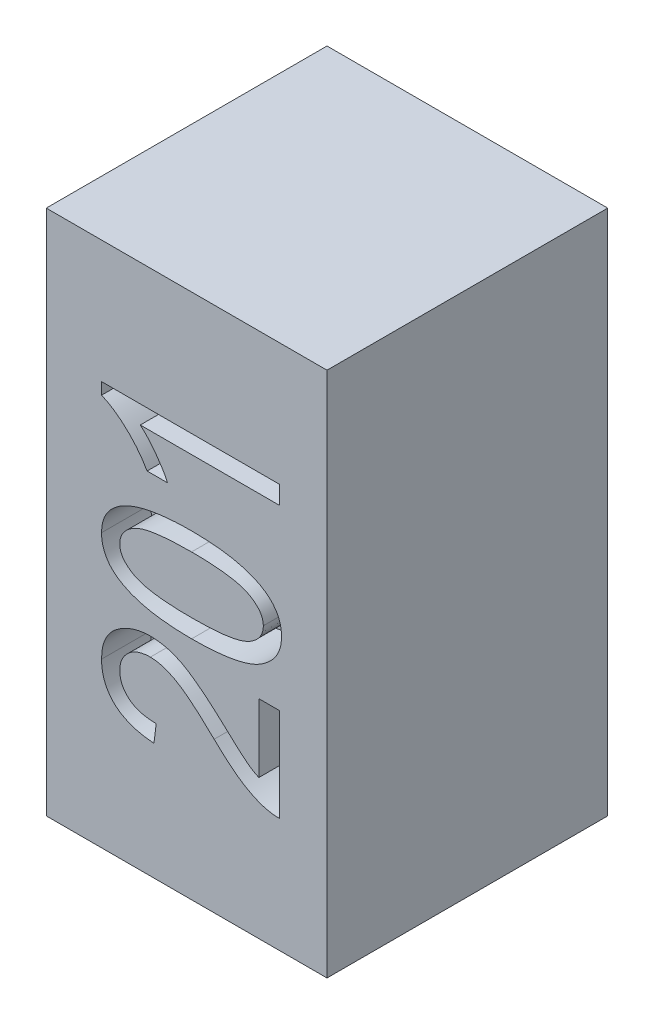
from build123d import *

# Parameters (mm, degrees)
ESQUISSE1_W             = 0.8
ESQUISSE1_H             = 1.5
BOSS_EXTRU_1_DEPTH      = 0.8
ENL_V_MAT_EXTRU_1_DEPTH = 0.14


with BuildPart() as part:
    # Esquisse1 → Boss.-Extru.1 (new body)
    with BuildSketch(Plane.XY):
        Rectangle(ESQUISSE1_W, ESQUISSE1_H)
    extrude(amount=BOSS_EXTRU_1_DEPTH)

    # Esquisse2 → Enl_v. mat.-Extru.1 (cut)
    # profile 1 of 3: a face of its own
    with BuildSketch(Plane.XY.offset(0.8)):
        with BuildLine():
            Line((0.205570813, -0.157792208), (0.264012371, -0.157792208))
            Line((0.264012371, -0.157792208), (0.264012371, -0.424025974))
            add(Edge.make_bspline(
                [(0.264012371, -0.424025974), (0.260967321, -0.424038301), (0.254798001, -0.424063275), (0.245392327, -0.423232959), (0.235758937, -0.421527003), (0.22576932, -0.41934867), (0.215554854, -0.416260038), (0.205065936, -0.412478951), (0.194328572, -0.408017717), (0.183279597, -0.402793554), (0.171811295, -0.396690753), (0.159978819, -0.389318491), (0.147562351, -0.38089399), (0.134716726, -0.371213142), (0.12131985, -0.360450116), (0.10743377, -0.348551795), (0.092982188, -0.33556787), (0.083383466, -0.326315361), (0.078440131, -0.321550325)],
                knots=[0, 0, 0, 0, 0.672196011, 1.361880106, 2.081368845, 2.831486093, 3.618364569, 4.435734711, 5.292876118, 6.184871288, 7.133796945, 8.159796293, 9.26180684, 10.446293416, 11.710635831, 13.056147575, 14.483918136, 16, 16, 16, 16], degree=3))
            add(Edge.make_bspline(
                [(0.078440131, -0.321550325), (0.072713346, -0.316013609), (0.061686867, -0.305353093), (0.045405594, -0.290349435), (0.030272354, -0.276717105), (0.016013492, -0.264728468), (0.002823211, -0.254170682), (-0.009279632, -0.244937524), (-0.020569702, -0.237470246), (-0.033854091, -0.229407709), (-0.049668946, -0.221721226), (-0.068103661, -0.214925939), (-0.085924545, -0.210535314), (-0.097673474, -0.210000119), (-0.103378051, -0.20974026)],
                knots=[0, 0, 0, 0, 1.312560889, 2.527233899, 3.64818266, 4.668586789, 5.596397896, 6.432357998, 7.175835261, 7.825761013, 8.992224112, 10.065918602, 11.060925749, 12, 12, 12, 12], degree=3))
            add(Edge.make_bspline(
                [(-0.103378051, -0.20974026), (-0.106527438, -0.209776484), (-0.112678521, -0.209847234), (-0.121661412, -0.211049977), (-0.130205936, -0.212764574), (-0.138371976, -0.215030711), (-0.146032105, -0.218235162), (-0.153239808, -0.222118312), (-0.160090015, -0.226558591), (-0.16634486, -0.231739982), (-0.171987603, -0.237403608), (-0.177039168, -0.243386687), (-0.181168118, -0.24979007), (-0.184588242, -0.256481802), (-0.187205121, -0.26350197), (-0.18916589, -0.27083284), (-0.19027981, -0.278496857), (-0.190447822, -0.283701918), (-0.190533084, -0.286343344)],
                knots=[0, 0, 0, 0, 1.164144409, 2.273695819, 3.345940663, 4.387378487, 5.402712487, 6.410231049, 7.41307794, 8.417484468, 9.408318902, 10.367853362, 11.308274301, 12.220303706, 13.142827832, 14.074469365, 15.022846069, 16, 16, 16, 16], degree=3))
            add(Edge.make_bspline(
                [(-0.190533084, -0.286343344), (-0.190473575, -0.289191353), (-0.190357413, -0.294750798), (-0.188904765, -0.302851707), (-0.186978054, -0.3106229), (-0.183932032, -0.317967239), (-0.180250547, -0.325024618), (-0.175445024, -0.331504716), (-0.170081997, -0.337780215), (-0.163790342, -0.343548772), (-0.156646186, -0.34869795), (-0.148843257, -0.35331999), (-0.140187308, -0.357045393), (-0.130892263, -0.360176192), (-0.120846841, -0.362635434), (-0.110082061, -0.364277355), (-0.098602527, -0.36548204), (-0.09069885, -0.365549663), (-0.08663698, -0.365584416)],
                knots=[0, 0, 0, 0, 0.928593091, 1.812656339, 2.680433, 3.537535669, 4.402074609, 5.272376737, 6.164676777, 7.094647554, 8.050991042, 9.035788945, 10.049325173, 11.121325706, 12.235436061, 13.420862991, 14.67452591, 16, 16, 16, 16], degree=3))
            Line((-0.08663698, -0.365584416), (-0.093130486, -0.417532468))
            add(Edge.make_bspline(
                [(-0.093130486, -0.417532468), (-0.099158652, -0.416997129), (-0.110853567, -0.415958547), (-0.127783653, -0.413233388), (-0.143492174, -0.409452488), (-0.158133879, -0.404961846), (-0.171533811, -0.399320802), (-0.183937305, -0.39297169), (-0.195128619, -0.385547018), (-0.205126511, -0.377201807), (-0.213893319, -0.368005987), (-0.221512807, -0.358126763), (-0.228121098, -0.347610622), (-0.233366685, -0.336309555), (-0.237456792, -0.324298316), (-0.240381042, -0.311621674), (-0.242125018, -0.298228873), (-0.242360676, -0.289088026), (-0.242481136, -0.284415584)],
                knots=[0, 0, 0, 0, 1.296016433, 2.514330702, 3.668705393, 4.754684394, 5.790583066, 6.778804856, 7.735156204, 8.660808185, 9.562568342, 10.450784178, 11.329227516, 12.217177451, 13.112894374, 14.042449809, 14.999377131, 16, 16, 16, 16], degree=3))
            add(Edge.make_bspline(
                [(-0.242481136, -0.284415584), (-0.242334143, -0.279370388), (-0.242047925, -0.269546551), (-0.240132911, -0.255252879), (-0.236832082, -0.241881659), (-0.231978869, -0.22952981), (-0.226018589, -0.218063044), (-0.218616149, -0.207585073), (-0.209815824, -0.198106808), (-0.19978414, -0.189679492), (-0.188958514, -0.182229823), (-0.177637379, -0.175730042), (-0.16600985, -0.170091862), (-0.153946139, -0.165685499), (-0.141608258, -0.162005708), (-0.128809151, -0.159693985), (-0.115696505, -0.158066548), (-0.106832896, -0.157884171), (-0.102363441, -0.157792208)],
                knots=[0, 0, 0, 0, 1.141316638, 2.222333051, 3.255980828, 4.24919085, 5.217781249, 6.173073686, 7.14226832, 8.135684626, 9.131102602, 10.111468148, 11.086834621, 12.050425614, 13.014198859, 13.995608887, 14.989290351, 16, 16, 16, 16], degree=3))
            add(Edge.make_bspline(
                [(-0.102363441, -0.157792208), (-0.098336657, -0.157878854), (-0.090335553, -0.158051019), (-0.078397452, -0.159170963), (-0.06661985, -0.161147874), (-0.0548895, -0.163714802), (-0.043388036, -0.167357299), (-0.03193276, -0.171480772), (-0.020653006, -0.176482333), (-0.009328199, -0.182386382), (0.002440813, -0.189300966), (0.014875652, -0.197579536), (0.028301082, -0.207121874), (0.042559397, -0.218122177), (0.057808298, -0.230404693), (0.073926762, -0.244127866), (0.090947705, -0.25924549), (0.102503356, -0.269888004), (0.108472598, -0.275385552)],
                knots=[0, 0, 0, 0, 0.780531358, 1.550893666, 2.321451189, 3.094347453, 3.876089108, 4.657940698, 5.453333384, 6.265487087, 7.132311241, 8.097757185, 9.160053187, 10.324349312, 11.587703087, 12.955031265, 14.427076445, 16, 16, 16, 16], degree=3))
            add(Edge.make_bspline(
                [(0.108472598, -0.275385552), (0.112183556, -0.278879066), (0.119275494, -0.285555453), (0.129562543, -0.294945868), (0.138788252, -0.303550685), (0.147186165, -0.311077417), (0.154576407, -0.317770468), (0.161200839, -0.323272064), (0.166736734, -0.328002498), (0.17560759, -0.334903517), (0.18812033, -0.343612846), (0.199888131, -0.349671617), (0.205570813, -0.352597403)],
                knots=[0, 0, 0, 0, 1.227426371, 2.345710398, 3.354421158, 4.265580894, 5.061720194, 5.755250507, 6.339260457, 6.815034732, 8.461977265, 10, 10, 10, 10], degree=3))
            Line((0.205570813, -0.352597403), (0.205570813, -0.157792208))
        make_face()
    # profile 2 of 3: a face of its own
    with BuildSketch(Plane.XY.offset(0.8)):
        with BuildLine():
            add(Edge.make_bspline(
                [(0.014215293, -0.105844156), (0.00399922, -0.105761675), (-0.015837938, -0.105601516), (-0.044609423, -0.103945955), (-0.071488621, -0.101335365), (-0.096438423, -0.097782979), (-0.119466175, -0.092983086), (-0.140627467, -0.087297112), (-0.15986302, -0.080395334), (-0.177188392, -0.07253586), (-0.192536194, -0.063617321), (-0.205858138, -0.053609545), (-0.217263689, -0.042656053), (-0.22651725, -0.030532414), (-0.233692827, -0.01742418), (-0.238823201, -0.003303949), (-0.241927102, 0.011816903), (-0.242293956, 0.022252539), (-0.242481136, 0.02757711)],
                knots=[0, 0, 0, 0, 1.522177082, 2.955701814, 4.292601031, 5.54555501, 6.7088804, 7.795771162, 8.808034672, 9.750647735, 10.627079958, 11.44753433, 12.228026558, 12.97593222, 13.711165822, 14.446140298, 15.20717461, 16, 16, 16, 16], degree=3))
            add(Edge.make_bspline(
                [(-0.242481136, 0.02757711), (-0.242343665, 0.032325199), (-0.242073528, 0.041655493), (-0.23939859, 0.055203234), (-0.235410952, 0.068049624), (-0.229526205, 0.080007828), (-0.222033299, 0.09121315), (-0.212815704, 0.101532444), (-0.202069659, 0.111232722), (-0.193920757, 0.11675598), (-0.189721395, 0.119602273)],
                knots=[0, 0, 0, 0, 1.02455918, 2.013323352, 2.972239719, 3.92313388, 4.881632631, 5.875512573, 6.905191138, 8, 8, 8, 8], degree=3))
            add(Edge.make_bspline(
                [(-0.189721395, 0.119602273), (-0.184070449, 0.122906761), (-0.172318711, 0.129778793), (-0.15262831, 0.137981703), (-0.130607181, 0.144917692), (-0.106233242, 0.150703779), (-0.079455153, 0.154904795), (-0.050381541, 0.158180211), (-0.0188866, 0.160089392), (0.002916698, 0.160287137), (0.014215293, 0.16038961)],
                knots=[0, 0, 0, 0, 0.745752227, 1.550870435, 2.425309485, 3.376577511, 4.404263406, 5.514061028, 6.71177208, 8, 8, 8, 8], degree=3))
            add(Edge.make_bspline(
                [(0.014215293, 0.16038961), (0.024363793, 0.160307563), (0.044065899, 0.160148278), (0.072667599, 0.158485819), (0.099413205, 0.155885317), (0.124290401, 0.152311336), (0.147263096, 0.147557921), (0.168352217, 0.141789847), (0.187606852, 0.135073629), (0.204927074, 0.127150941), (0.220349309, 0.118262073), (0.233741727, 0.108322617), (0.245102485, 0.097331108), (0.254458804, 0.085318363), (0.261608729, 0.072121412), (0.266860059, 0.058002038), (0.269953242, 0.042794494), (0.270318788, 0.032326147), (0.270505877, 0.026968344)],
                knots=[0, 0, 0, 0, 1.514074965, 2.939396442, 4.273020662, 5.522618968, 6.687464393, 7.770909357, 8.782798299, 9.726643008, 10.608576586, 11.434138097, 12.208514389, 12.960468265, 13.696662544, 14.439073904, 15.201102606, 16, 16, 16, 16], degree=3))
            add(Edge.make_bspline(
                [(0.270505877, 0.026968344), (0.270326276, 0.022188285), (0.269973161, 0.012790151), (0.267293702, -0.001001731), (0.26265949, -0.014045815), (0.256334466, -0.026472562), (0.248066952, -0.038089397), (0.23813936, -0.049170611), (0.226282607, -0.05945192), (0.212666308, -0.069245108), (0.196783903, -0.07804048), (0.178321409, -0.085463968), (0.157341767, -0.09184165), (0.133695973, -0.09686382), (0.107531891, -0.101073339), (0.078722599, -0.103760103), (0.047347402, -0.105514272), (0.025547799, -0.105731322), (0.014215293, -0.105844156)],
                knots=[0, 0, 0, 0, 0.713852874, 1.403515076, 2.08903769, 2.775973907, 3.479633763, 4.213082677, 4.993526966, 5.819329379, 6.714934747, 7.698240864, 8.786642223, 9.986811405, 11.306714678, 12.743554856, 14.307139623, 16, 16, 16, 16], degree=3))
        make_face()
        with BuildLine():
            add(Edge.make_bspline(
                [(0.014012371, -0.053896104), (0.023753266, -0.053804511), (0.042395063, -0.053629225), (0.069098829, -0.052690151), (0.093263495, -0.050876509), (0.114937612, -0.048393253), (0.134119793, -0.045201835), (0.150848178, -0.041355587), (0.165024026, -0.036635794), (0.176895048, -0.031195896), (0.186756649, -0.025071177), (0.19525943, -0.018696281), (0.202450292, -0.01187819), (0.208299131, -0.004596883), (0.212954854, 0.003051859), (0.216227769, 0.011169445), (0.218243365, 0.019699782), (0.218452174, 0.025536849), (0.218557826, 0.02849026)],
                knots=[0, 0, 0, 0, 1.930680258, 3.694870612, 5.294765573, 6.732327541, 8.017244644, 9.14720992, 10.130763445, 10.973463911, 11.728776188, 12.427251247, 13.076760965, 13.687074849, 14.273357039, 14.844695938, 15.415444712, 16, 16, 16, 16], degree=3))
            add(Edge.make_bspline(
                [(0.218557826, 0.02849026), (0.218461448, 0.031277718), (0.218269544, 0.036827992), (0.216075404, 0.044920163), (0.21284843, 0.052714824), (0.208199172, 0.060132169), (0.202087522, 0.067007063), (0.194822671, 0.073654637), (0.186244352, 0.079928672), (0.176250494, 0.085919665), (0.164334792, 0.09141462), (0.150040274, 0.095948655), (0.133344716, 0.09984666), (0.114234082, 0.103069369), (0.092646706, 0.105382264), (0.068626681, 0.107245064), (0.04212419, 0.108170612), (0.023651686, 0.108348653), (0.014012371, 0.108441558)],
                knots=[0, 0, 0, 0, 0.556166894, 1.107416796, 1.665226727, 2.239567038, 2.848554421, 3.499699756, 4.205927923, 4.970429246, 5.826979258, 6.823810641, 7.964115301, 9.254120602, 10.697341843, 12.305131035, 14.071945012, 16, 16, 16, 16], degree=3))
            add(Edge.make_bspline(
                [(0.014012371, 0.108441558), (0.004271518, 0.108349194), (-0.014403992, 0.10817211), (-0.041142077, 0.10724067), (-0.065373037, 0.105413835), (-0.087083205, 0.102947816), (-0.106297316, 0.099745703), (-0.123028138, 0.095903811), (-0.137196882, 0.091173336), (-0.149063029, 0.085777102), (-0.158835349, 0.079572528), (-0.167378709, 0.073287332), (-0.174387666, 0.066283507), (-0.180314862, 0.059035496), (-0.184924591, 0.051282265), (-0.188223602, 0.043041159), (-0.190207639, 0.034367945), (-0.190424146, 0.028432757), (-0.190533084, 0.025446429)],
                knots=[0, 0, 0, 0, 1.925955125, 3.692509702, 5.288489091, 6.729174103, 8.01094651, 9.138146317, 10.1192927, 10.959930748, 11.707705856, 12.404471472, 13.052253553, 13.661073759, 14.251664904, 14.827808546, 15.410204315, 16, 16, 16, 16], degree=3))
            add(Edge.make_bspline(
                [(-0.190533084, 0.025446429), (-0.190439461, 0.022658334), (-0.190254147, 0.017139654), (-0.188047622, 0.009117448), (-0.184829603, 0.001414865), (-0.180135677, -0.005869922), (-0.174171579, -0.012798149), (-0.166923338, -0.019417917), (-0.158283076, -0.025562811), (-0.148336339, -0.031634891), (-0.136325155, -0.036881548), (-0.122113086, -0.041571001), (-0.105368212, -0.045263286), (-0.08624562, -0.048529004), (-0.064620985, -0.050834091), (-0.040602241, -0.052700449), (-0.014099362, -0.053624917), (0.004373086, -0.053803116), (0.014012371, -0.053896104)],
                knots=[0, 0, 0, 0, 0.557032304, 1.102574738, 1.655014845, 2.224515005, 2.830031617, 3.482190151, 4.185515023, 4.951205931, 5.812452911, 6.804401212, 7.944931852, 9.243623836, 10.689090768, 12.299381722, 14.068944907, 16, 16, 16, 16], degree=3))
        make_face(mode=Mode.SUBTRACT)
    # profile 3 of 3: a face of its own
    with BuildSketch(Plane.XY.offset(0.8)):
        with BuildLine():
            Line((0.264012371, 0.400649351), (0.264012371, 0.348701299))
            Line((0.264012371, 0.348701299), (-0.132091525, 0.348701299))
            add(Edge.make_bspline(
                [(-0.132091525, 0.348701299), (-0.128420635, 0.345509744), (-0.120812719, 0.33889525), (-0.109979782, 0.327454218), (-0.098935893, 0.31459158), (-0.088079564, 0.300479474), (-0.077739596, 0.286004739), (-0.068479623, 0.2718196), (-0.060561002, 0.258245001), (-0.056242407, 0.249164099), (-0.054169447, 0.244805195)],
                knots=[0, 0, 0, 0, 0.892632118, 1.84997915, 2.889208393, 4.004565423, 5.117638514, 6.154471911, 7.114131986, 8, 8, 8, 8], degree=3))
            Line((-0.054169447, 0.244805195), (-0.112611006, 0.244805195))
            add(Edge.make_bspline(
                [(-0.112611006, 0.244805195), (-0.116829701, 0.25181069), (-0.125230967, 0.265761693), (-0.139767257, 0.285351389), (-0.15557911, 0.30375761), (-0.172590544, 0.320590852), (-0.190049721, 0.335729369), (-0.20755672, 0.348633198), (-0.224842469, 0.359247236), (-0.236736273, 0.364450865), (-0.242481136, 0.366964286)],
                knots=[0, 0, 0, 0, 1.082336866, 2.155405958, 3.2255179, 4.292702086, 5.32152541, 6.282639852, 7.170492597, 8, 8, 8, 8], degree=3))
            Line((-0.242481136, 0.366964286), (-0.242481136, 0.400649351))
            Line((-0.242481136, 0.400649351), (0.264012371, 0.400649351))
        make_face()
    extrude(amount=-ENL_V_MAT_EXTRU_1_DEPTH, mode=Mode.SUBTRACT)


solid = part.part
